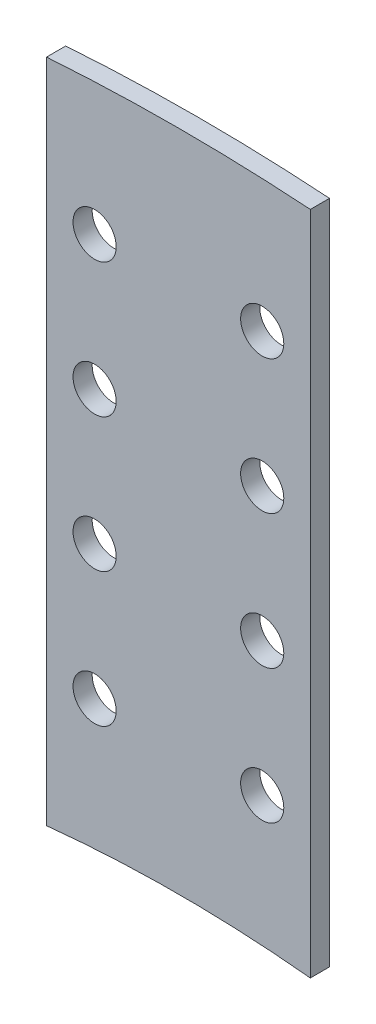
from build123d import *

# Parameters (mm, degrees)
ESQUISSE1_W                = 110
ESQUISSE1_H                = 279.43
BOSS_EXTRU_1_DEPTH         = 8
ESQUISSE2_R                = 9
ENL_V_MAT_EXTRU_1_DEPTH    = 151.36382951
R_P_TITION_LIN_AIRE3_COUNT = 4
R_P_TITION_LIN_AIRE3_PITCH = 55.88
ENL_V_MAT_EXTRU_2_DEPTH    = 151.36382951
ESQUISSE4_R                = 540
ENL_V_MAT_EXTRU_3_DEPTH    = 151.36382951


with BuildPart() as part:
    # Esquisse1 → Boss.-Extru.1 (new body)
    with BuildSketch(Plane.XY):
        Rectangle(ESQUISSE1_W, ESQUISSE1_H)
    extrude(amount=BOSS_EXTRU_1_DEPTH)

    # Esquisse2 → Enl_v. mat.-Extru.1 (cut, through all)
    with BuildSketch(Plane.XY.offset(8)):
        with Locations((-34.94, 83.835)):
            Circle(ESQUISSE2_R)
        with Locations((34.94, 83.835)):
            Circle(ESQUISSE2_R)
    enl_v_mat_extru_1 = extrude(amount=-ENL_V_MAT_EXTRU_1_DEPTH, mode=Mode.SUBTRACT)

    # R_p_tition lin_aire3: Enl_v. mat.-Extru.1 ×4
    with Locations(*[(0, -i * R_P_TITION_LIN_AIRE3_PITCH, 0) for i in range(1, R_P_TITION_LIN_AIRE3_COUNT)]):
        add(enl_v_mat_extru_1, mode=Mode.SUBTRACT)

    # Esquisse3 → Enl_v. mat.-Extru.2 (cut, through all)
    with BuildSketch(Plane.XY.offset(8)):
        with BuildLine():
            ThreePointArc((-55, 137.819642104), (-27.516324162, 139.241019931), (0, 139.715))
            Line((0, 139.715), (-55, 139.715))
            Line((-55, 139.715), (-55, 137.819642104))
        make_face()
        with BuildLine():
            Line((55, 137.819642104), (55, 139.715))
            Line((55, 139.715), (0, 139.715))
            ThreePointArc((0, 139.715), (27.516324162, 139.241019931), (55, 137.819642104))
        make_face()
    extrude(amount=-ENL_V_MAT_EXTRU_2_DEPTH, mode=Mode.SUBTRACT)

    # Esquisse4 → Enl_v. mat.-Extru.3 (cut, through all)
    with BuildSketch(Plane.XY.offset(8)):
        with Locations((0, -676.906772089)):
            Circle(ESQUISSE4_R)
    extrude(amount=-ENL_V_MAT_EXTRU_3_DEPTH, mode=Mode.SUBTRACT)


solid = part.part
